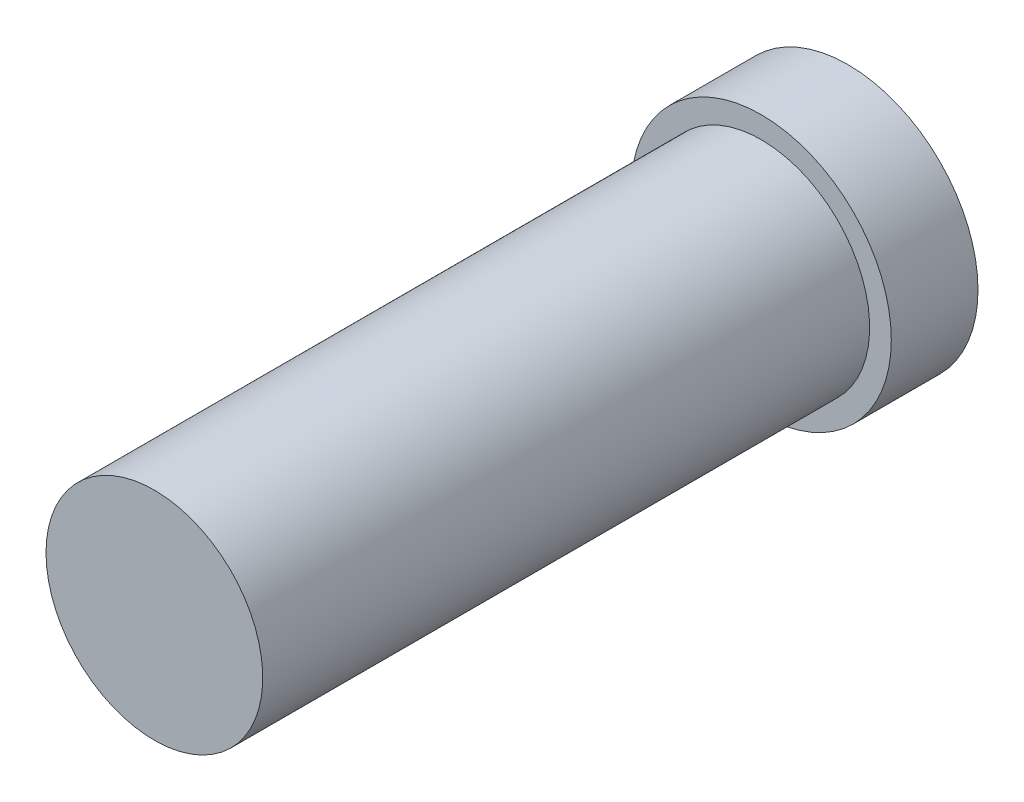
from build123d import *


with BuildPart() as part:
    # Logo3_bib1 → Revolve1 (revolve)
    with BuildSketch(Plane(origin=(0, 0, 0), x_dir=(-1, 0, 0), z_dir=(0, -1, 0))):
        Polygon((7.9375, 0), (9.525, 0), (9.525, 6.35), (0, 6.35), (0, -44.45), (7.9375, -44.45), align=None)
    revolve(axis=Axis((0, 0, -16.546754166), (0, 0, 1)))


solid = part.part
